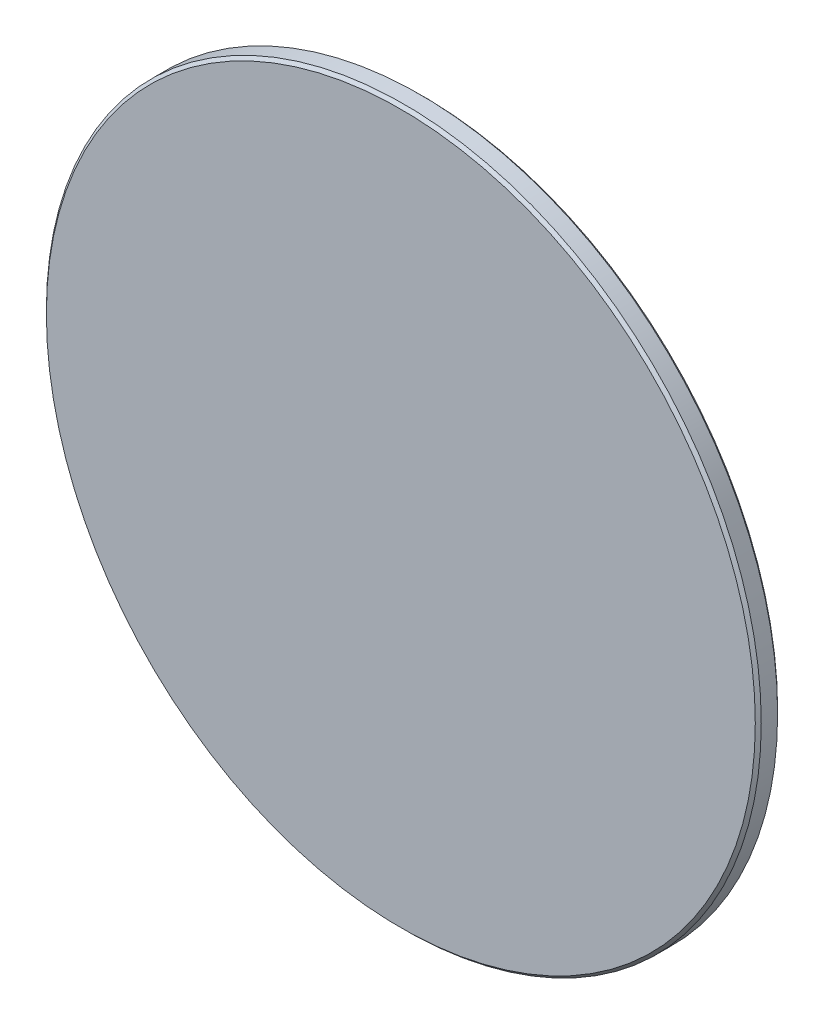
from build123d import *

# Parameters (mm, degrees)
SKETCH1_R           = 76.2
BOSS_EXTRUDE1_DEPTH = 2.38125
CHAMFER1_SIZE       = 0.635


with BuildPart() as part:
    # Sketch1 → Boss-Extrude1 (new, symmetric)
    with BuildSketch(Plane.XY):
        with Locations(Location((0, 0, 0), (0, 0, 180))):
            Circle(SKETCH1_R)
    extrude(amount=BOSS_EXTRUDE1_DEPTH, both=True)

    # Chamfer1
    chamfer1_edges = [part.edges().sort_by_distance(p)[0] for p in [
        (76.2, 0, -2.38125),
        (76.2, 0, 2.38125),
    ]]
    chamfer(chamfer1_edges, length=CHAMFER1_SIZE)


solid = part.part
